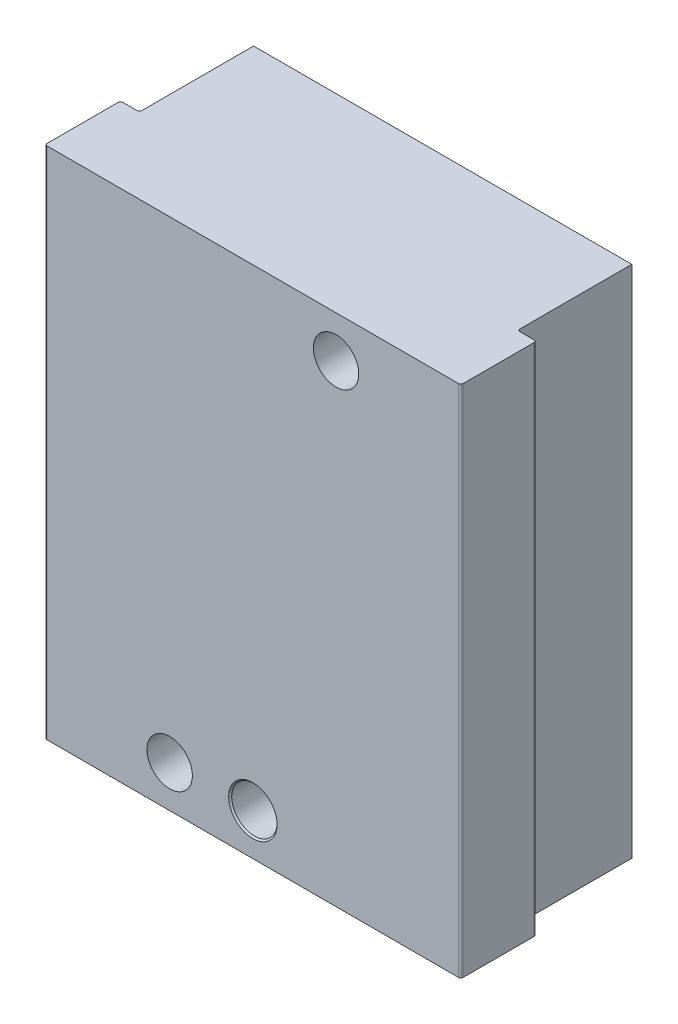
from build123d import *

# Parameters (mm, degrees)
SECTION_PROFIL_DEPTH    = 68
CONG_1_R                = 0.3
ESQUISSE4_R             = 3
ENL_V_MAT_EXTRU_2_DEPTH = 78.525866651
ESQUISSE7_R             = 1.5
ENL_V_MAT_EXTRU_5_DEPTH = 78.525866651
ESQUISSE8_R             = 3
ENL_V_MAT_EXTRU_6_DEPTH = 10
CHANFREIN2_SIZE         = 0.2


with BuildPart() as part:
    # Esquisse1 → section profil (new body)
    with BuildSketch(Plane(origin=(0, 0, 0), x_dir=(1, 0, 0), z_dir=(0, 1, 0))):
        Polygon((-25, 25.1), (25, 25.1), (25, 10), (27.5, 10), (27.5, 0), (-27.5, 0), (-27.5, 10), (-25, 10), align=None)
    extrude(amount=SECTION_PROFIL_DEPTH)

    # Cong_1
    cong_1_edges = [part.edges().sort_by_distance(p)[0] for p in [
        (27.5, 34, 0),
        (-27.5, 34, 0),
        (-27.5, 34, -10),
        (-25, 34, -10),
        (25, 34, -10),
        (27.5, 34, -10),
    ]]
    fillet(cong_1_edges, radius=CONG_1_R)

    # Esquisse4 → Enl_v. mat.-Extru.2 (cut, through all)
    with BuildSketch(Plane(origin=(0, 0, -25.1), x_dir=(-1, 0, 0), z_dir=(0, 0, -1))):
        with Locations((-11, 62.5)):
            Circle(ESQUISSE4_R)
        with Locations((11, 5.5)):
            Circle(ESQUISSE4_R)
    extrude(amount=-ENL_V_MAT_EXTRU_2_DEPTH, mode=Mode.SUBTRACT)

    # Esquisse7 → Enl_v. mat.-Extru.5 (cut, through all)
    with BuildSketch(Plane(origin=(0, 0, -25.1), x_dir=(-1, 0, 0), z_dir=(0, 0, -1))):
        with Locations((0, 5.5)):
            Circle(ESQUISSE7_R)
    extrude(amount=-ENL_V_MAT_EXTRU_5_DEPTH, mode=Mode.SUBTRACT)

    # Esquisse8 → Enl_v. mat.-Extru.6 (cut)
    with BuildSketch(Plane.XY):
        with Locations((0, 5.5)):
            Circle(ESQUISSE8_R)
    extrude(amount=-ENL_V_MAT_EXTRU_6_DEPTH, mode=Mode.SUBTRACT)

    # Chanfrein2
    chanfrein2_edges = [part.edges().sort_by_distance(p)[0] for p in [
        (-3, 5.5, 0),
    ]]
    chamfer(chanfrein2_edges, length=CHANFREIN2_SIZE)


solid = part.part
